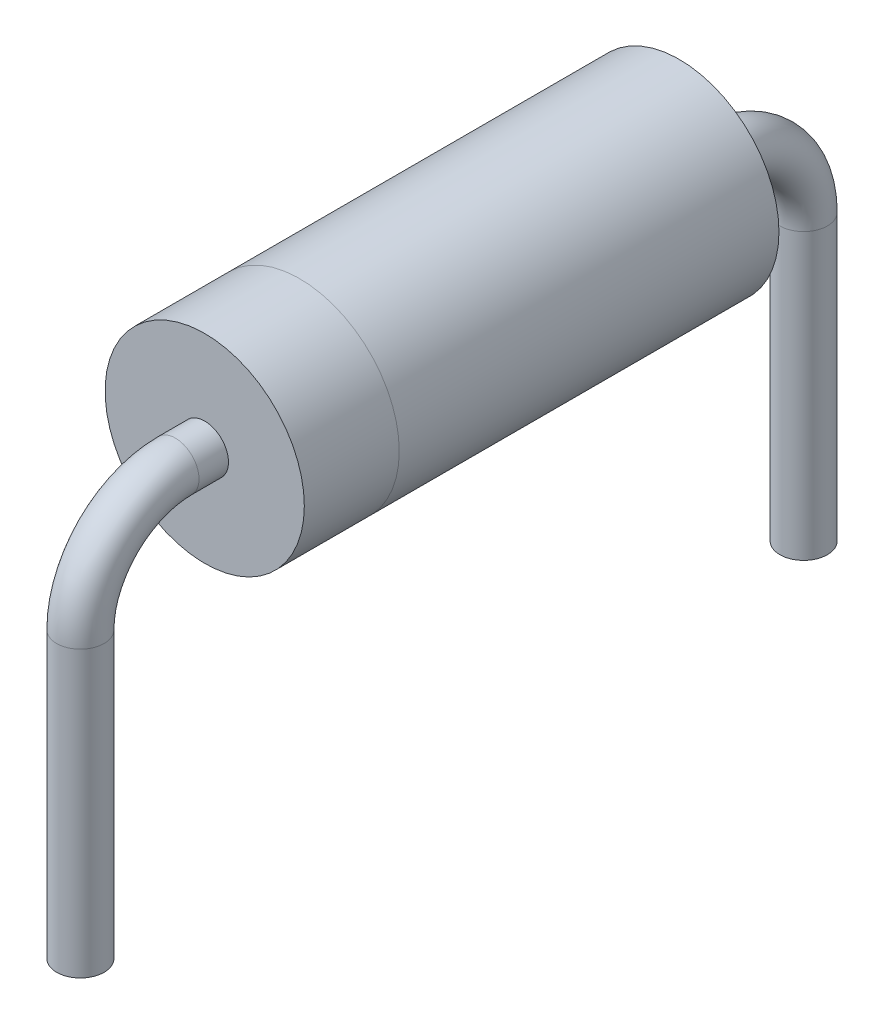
from build123d import *

# Parameters (mm, degrees)
ESQUISSE1_R        = 1.05
BOSS_EXTRU_1_DEPTH = 4
ESQUISSE2_R        = 1.0495
BOSS_EXTRU_2_DEPTH = 1
ESQUISSE4_R        = 0.25


with BuildPart() as part:
    # Esquisse1 → Boss.-Extru.1 (new body)
    with BuildSketch(Plane.XY):
        Circle(ESQUISSE1_R)
    extrude(amount=BOSS_EXTRU_1_DEPTH)

    # Esquisse2 → Boss.-Extru.2 (add)
    with BuildSketch(Plane.XY.offset(4)):
        Circle(ESQUISSE2_R)
    extrude(amount=BOSS_EXTRU_2_DEPTH)

    # Balayage1: sweep along a path in Esquisse3
    with BuildLine(Plane(origin=(0, 0, 0), x_dir=(0, 0, -1), z_dir=(1, 0, 0))) as balayage1_path:
        Line((-5, 0), (-5.31, 0))
        ThreePointArc((-5.31, 0), (-6.017106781, -0.292893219), (-6.31, -1))
        Line((-6.31, -1), (-6.31, -4))
    # Esquisse4 → Balayage1 (sweep)
    with BuildSketch(Plane.XY.offset(5)):
        Circle(ESQUISSE4_R)
    balayage1 = sweep(path=balayage1_path.line)

    # Sym_trie1: Balayage1 across plane
    add(balayage1.mirror(Plane.XY.offset(2.5)))


solid = part.part
